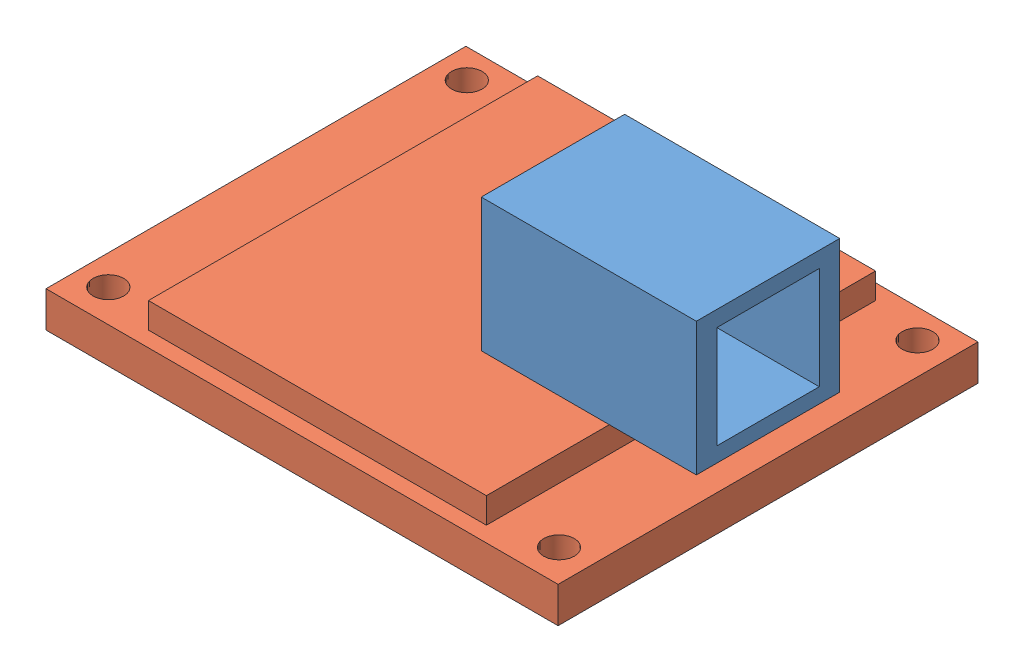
SolidWorks assembly Assem5.sldasm, configuration Default (file format 13000). Lengths in mm.
Overall size (50 19 41).
2 component instances, 2 part files, 3 mates.
Components (placement in the parent):
- 8 pin header-1: 8 pin header.SLDPRT [Default] at (-0.0382 15.3163 11.6778) size (21 13 14)
- medium-board-1: medium-board.SLDPRT [Default] at (-16.9576 2.8163 12.21) size (50 6 41)
Mates (geometry in assembly coordinates):
- Coincident1: coincident: plane of 8 pin header-1 through (-10.5382 8.8163 25.6778) normal (0 -1 0); plane of medium-board-1 through (-16.9576 8.8163 12.21) normal (0 1 0)
- Coincident3: coincident: plane of 8 pin header-1 through (10.4618 21.8163 25.6778) normal (1 0 0); plane of medium-board-1 through (10.4618 6.3163 -1.8222) normal (1 0 0)
- Distance2: distance = 12 mm aligned: plane of 8 pin header-1 through (-0.0382 15.3163 25.6778) normal (0 0 1); plane of medium-board-1 through (-31.0382 8.8163 37.6778) normal (0 0 1)
